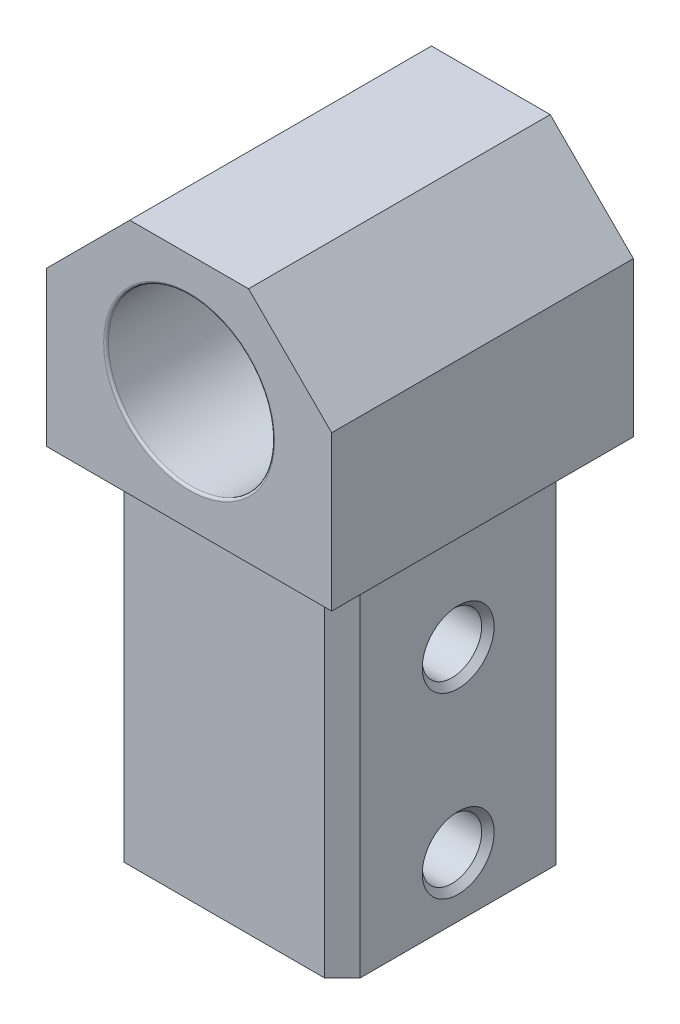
ISO-10303-21;
HEADER;
FILE_DESCRIPTION(('STEP AP214'),'2;1');
FILE_NAME('part.step','',(''),(''),'','','');
FILE_SCHEMA(('AUTOMOTIVE_DESIGN { 1 0 10303 214 1 1 1 1 }'));
ENDSEC;
DATA;
#1=APPLICATION_CONTEXT('core data for automotive mechanical design processes');
#2=APPLICATION_PROTOCOL_DEFINITION('international standard','automotive_design',2000,#1);
#3=PRODUCT_CONTEXT('',#1,'mechanical');
#4=PRODUCT('Part','Part','',(#3));
#5=PRODUCT_RELATED_PRODUCT_CATEGORY('part','',(#4));
#6=PRODUCT_DEFINITION_FORMATION('','',#4);
#7=PRODUCT_DEFINITION_CONTEXT('part definition',#1,'design');
#8=PRODUCT_DEFINITION('design','',#6,#7);
#9=PRODUCT_DEFINITION_SHAPE('','',#8);
#10=(LENGTH_UNIT() NAMED_UNIT(*) SI_UNIT(.MILLI.,.METRE.));
#11=(NAMED_UNIT(*) PLANE_ANGLE_UNIT() SI_UNIT($,.RADIAN.));
#12=(NAMED_UNIT(*) SI_UNIT($,.STERADIAN.) SOLID_ANGLE_UNIT());
#13=UNCERTAINTY_MEASURE_WITH_UNIT(LENGTH_MEASURE(1.E-05),#10,'distance_accuracy_value','');
#14=(GEOMETRIC_REPRESENTATION_CONTEXT(3) GLOBAL_UNCERTAINTY_ASSIGNED_CONTEXT((#13)) GLOBAL_UNIT_ASSIGNED_CONTEXT((#10,
#11,#12)) REPRESENTATION_CONTEXT('',''));
#15=CARTESIAN_POINT('',(0.,0.,0.));
#16=DIRECTION('',(0.,0.,1.));
#17=DIRECTION('',(1.,0.,0.));
#18=AXIS2_PLACEMENT_3D('',#15,#16,#17);
#19=CARTESIAN_POINT('',(9.95,-30.,-9.75));
#20=DIRECTION('',(1.,0.,0.));
#21=DIRECTION('',(0.,0.,-1.));
#22=AXIS2_PLACEMENT_3D('',#19,#20,#21);
#23=PLANE('',#22);
#24=CARTESIAN_POINT('',(9.95,-10.,0.));
#25=DIRECTION('',(1.,0.,0.));
#26=DIRECTION('',(0.,0.,-1.));
#27=AXIS2_PLACEMENT_3D('',#24,#25,#26);
#28=CIRCLE('',#27,3.025);
#29=CARTESIAN_POINT('',(9.95,-10.,-3.025));
#30=VERTEX_POINT('',#29);
#31=EDGE_CURVE('E347',#30,#30,#28,.T.);
#32=ORIENTED_EDGE('',*,*,#31,.F.);
#33=EDGE_LOOP('',(#32));
#34=FACE_BOUND('',#33,.T.);
#35=CARTESIAN_POINT('',(9.95,-25.,0.));
#36=DIRECTION('',(1.,0.,0.));
#37=DIRECTION('',(0.,0.,-1.));
#38=AXIS2_PLACEMENT_3D('',#35,#36,#37);
#39=CIRCLE('',#38,3.025);
#40=CARTESIAN_POINT('',(9.95,-25.,-3.025));
#41=VERTEX_POINT('',#40);
#42=EDGE_CURVE('E331',#41,#41,#39,.T.);
#43=ORIENTED_EDGE('',*,*,#42,.F.);
#44=EDGE_LOOP('',(#43));
#45=FACE_BOUND('',#44,.T.);
#46=DIRECTION('',(0.,0.,-1.));
#47=VECTOR('',#46,1.);
#48=CARTESIAN_POINT('',(9.95,-30.,-9.75));
#49=LINE('',#48,#47);
#50=CARTESIAN_POINT('',(9.95,-30.,8.24999999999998));
#51=VERTEX_POINT('',#50);
#52=CARTESIAN_POINT('',(9.95,-30.,-8.25000000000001));
#53=VERTEX_POINT('',#52);
#54=EDGE_CURVE('E194',#51,#53,#49,.T.);
#55=ORIENTED_EDGE('',*,*,#54,.T.);
#56=DIRECTION('',(0.,1.,0.));
#57=VECTOR('',#56,1.);
#58=CARTESIAN_POINT('',(9.95,-30.,-8.25000000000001));
#59=LINE('',#58,#57);
#60=CARTESIAN_POINT('',(9.95,0.,-8.25000000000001));
#61=VERTEX_POINT('',#60);
#62=EDGE_CURVE('E228',#53,#61,#59,.T.);
#63=ORIENTED_EDGE('',*,*,#62,.T.);
#64=DIRECTION('',(0.,0.,-1.));
#65=VECTOR('',#64,1.);
#66=CARTESIAN_POINT('',(9.95,0.,-9.75000000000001));
#67=LINE('',#66,#65);
#68=CARTESIAN_POINT('',(9.95,0.,8.24999999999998));
#69=VERTEX_POINT('',#68);
#70=EDGE_CURVE('E152',#69,#61,#67,.T.);
#71=ORIENTED_EDGE('',*,*,#70,.F.);
#72=DIRECTION('',(0.,-1.,0.));
#73=VECTOR('',#72,1.);
#74=CARTESIAN_POINT('',(9.95,-30.,8.24999999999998));
#75=LINE('',#74,#73);
#76=EDGE_CURVE('E211',#69,#51,#75,.T.);
#77=ORIENTED_EDGE('',*,*,#76,.T.);
#78=EDGE_LOOP('',(#55,#63,#71,#77));
#79=FACE_BOUND('',#78,.T.);
#80=ADVANCED_FACE('F40',(#34,#45,#79),#23,.T.);
#81=CARTESIAN_POINT('',(-9.95,-30.,9.75));
#82=DIRECTION('',(0.,0.,1.));
#83=DIRECTION('',(1.,0.,0.));
#84=AXIS2_PLACEMENT_3D('',#81,#82,#83);
#85=PLANE('',#84);
#86=DIRECTION('',(1.,0.,0.));
#87=VECTOR('',#86,1.);
#88=CARTESIAN_POINT('',(-9.95,-30.,9.75));
#89=LINE('',#88,#87);
#90=CARTESIAN_POINT('',(-8.44999999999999,-30.,9.75));
#91=VERTEX_POINT('',#90);
#92=CARTESIAN_POINT('',(8.44999999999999,-30.,9.75));
#93=VERTEX_POINT('',#92);
#94=EDGE_CURVE('E207',#91,#93,#89,.T.);
#95=ORIENTED_EDGE('',*,*,#94,.T.);
#96=DIRECTION('',(0.,1.,0.));
#97=VECTOR('',#96,1.);
#98=CARTESIAN_POINT('',(8.45,-30.,9.75));
#99=LINE('',#98,#97);
#100=CARTESIAN_POINT('',(8.44999999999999,0.,9.75));
#101=VERTEX_POINT('',#100);
#102=EDGE_CURVE('E254',#93,#101,#99,.T.);
#103=ORIENTED_EDGE('',*,*,#102,.T.);
#104=DIRECTION('',(1.,0.,0.));
#105=VECTOR('',#104,1.);
#106=CARTESIAN_POINT('',(-9.95,0.,9.75));
#107=LINE('',#106,#105);
#108=CARTESIAN_POINT('',(-8.44999999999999,0.,9.74999999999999));
#109=VERTEX_POINT('',#108);
#110=EDGE_CURVE('E199',#109,#101,#107,.T.);
#111=ORIENTED_EDGE('',*,*,#110,.F.);
#112=DIRECTION('',(0.,-1.,0.));
#113=VECTOR('',#112,1.);
#114=CARTESIAN_POINT('',(-8.44999999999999,-30.,9.75));
#115=LINE('',#114,#113);
#116=EDGE_CURVE('E251',#109,#91,#115,.T.);
#117=ORIENTED_EDGE('',*,*,#116,.T.);
#118=EDGE_LOOP('',(#95,#103,#111,#117));
#119=FACE_BOUND('',#118,.T.);
#120=ADVANCED_FACE('F382',(#119),#85,.T.);
#121=CARTESIAN_POINT('',(-9.95,-30.,-9.75));
#122=DIRECTION('',(-1.,0.,0.));
#123=DIRECTION('',(0.,0.,1.));
#124=AXIS2_PLACEMENT_3D('',#121,#122,#123);
#125=PLANE('',#124);
#126=CARTESIAN_POINT('',(-9.95,-10.,0.));
#127=DIRECTION('',(1.,0.,0.));
#128=DIRECTION('',(0.,0.,-1.));
#129=AXIS2_PLACEMENT_3D('',#126,#127,#128);
#130=CIRCLE('',#129,3.02499999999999);
#131=CARTESIAN_POINT('',(-9.95,-10.,-3.02499999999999));
#132=VERTEX_POINT('',#131);
#133=EDGE_CURVE('E351',#132,#132,#130,.T.);
#134=ORIENTED_EDGE('',*,*,#133,.T.);
#135=EDGE_LOOP('',(#134));
#136=FACE_BOUND('',#135,.T.);
#137=CARTESIAN_POINT('',(-9.95,-25.,0.));
#138=DIRECTION('',(1.,0.,0.));
#139=DIRECTION('',(0.,0.,-1.));
#140=AXIS2_PLACEMENT_3D('',#137,#138,#139);
#141=CIRCLE('',#140,3.025);
#142=CARTESIAN_POINT('',(-9.95,-25.,-3.025));
#143=VERTEX_POINT('',#142);
#144=EDGE_CURVE('E335',#143,#143,#141,.T.);
#145=ORIENTED_EDGE('',*,*,#144,.T.);
#146=EDGE_LOOP('',(#145));
#147=FACE_BOUND('',#146,.T.);
#148=DIRECTION('',(0.,0.,1.));
#149=VECTOR('',#148,1.);
#150=CARTESIAN_POINT('',(-9.95,-30.,-9.75));
#151=LINE('',#150,#149);
#152=CARTESIAN_POINT('',(-9.95,-30.,-8.25));
#153=VERTEX_POINT('',#152);
#154=CARTESIAN_POINT('',(-9.95,-30.,8.25000000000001));
#155=VERTEX_POINT('',#154);
#156=EDGE_CURVE('E203',#153,#155,#151,.T.);
#157=ORIENTED_EDGE('',*,*,#156,.T.);
#158=DIRECTION('',(0.,1.,0.));
#159=VECTOR('',#158,1.);
#160=CARTESIAN_POINT('',(-9.95,-30.,8.25000000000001));
#161=LINE('',#160,#159);
#162=CARTESIAN_POINT('',(-9.95,0.,8.25000000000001));
#163=VERTEX_POINT('',#162);
#164=EDGE_CURVE('E261',#155,#163,#161,.T.);
#165=ORIENTED_EDGE('',*,*,#164,.T.);
#166=DIRECTION('',(0.,0.,1.));
#167=VECTOR('',#166,1.);
#168=CARTESIAN_POINT('',(-9.95,0.,-9.75));
#169=LINE('',#168,#167);
#170=CARTESIAN_POINT('',(-9.95,0.,-8.25));
#171=VERTEX_POINT('',#170);
#172=EDGE_CURVE('E219',#171,#163,#169,.T.);
#173=ORIENTED_EDGE('',*,*,#172,.F.);
#174=DIRECTION('',(0.,-1.,0.));
#175=VECTOR('',#174,1.);
#176=CARTESIAN_POINT('',(-9.95,-30.,-8.25));
#177=LINE('',#176,#175);
#178=EDGE_CURVE('E258',#171,#153,#177,.T.);
#179=ORIENTED_EDGE('',*,*,#178,.T.);
#180=EDGE_LOOP('',(#157,#165,#173,#179));
#181=FACE_BOUND('',#180,.T.);
#182=ADVANCED_FACE('F357',(#136,#147,#181),#125,.T.);
#183=CARTESIAN_POINT('',(-9.95,-30.,-9.75));
#184=DIRECTION('',(0.,0.,-1.));
#185=DIRECTION('',(-1.,0.,0.));
#186=AXIS2_PLACEMENT_3D('',#183,#184,#185);
#187=PLANE('',#186);
#188=DIRECTION('',(-1.,0.,0.));
#189=VECTOR('',#188,1.);
#190=CARTESIAN_POINT('',(-9.95,0.,-9.75));
#191=LINE('',#190,#189);
#192=CARTESIAN_POINT('',(8.45,0.,-9.75));
#193=VERTEX_POINT('',#192);
#194=CARTESIAN_POINT('',(-8.45,0.,-9.75000000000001));
#195=VERTEX_POINT('',#194);
#196=EDGE_CURVE('E215',#193,#195,#191,.T.);
#197=ORIENTED_EDGE('',*,*,#196,.F.);
#198=DIRECTION('',(0.,-1.,0.));
#199=VECTOR('',#198,1.);
#200=CARTESIAN_POINT('',(8.45,-30.,-9.75));
#201=LINE('',#200,#199);
#202=CARTESIAN_POINT('',(8.45,-30.,-9.75));
#203=VERTEX_POINT('',#202);
#204=EDGE_CURVE('E236',#193,#203,#201,.T.);
#205=ORIENTED_EDGE('',*,*,#204,.T.);
#206=DIRECTION('',(-1.,0.,0.));
#207=VECTOR('',#206,1.);
#208=CARTESIAN_POINT('',(-9.95,-30.,-9.75));
#209=LINE('',#208,#207);
#210=CARTESIAN_POINT('',(-8.45,-30.,-9.75));
#211=VERTEX_POINT('',#210);
#212=EDGE_CURVE('E198',#203,#211,#209,.T.);
#213=ORIENTED_EDGE('',*,*,#212,.T.);
#214=DIRECTION('',(0.,1.,0.));
#215=VECTOR('',#214,1.);
#216=CARTESIAN_POINT('',(-8.45,-30.,-9.75));
#217=LINE('',#216,#215);
#218=EDGE_CURVE('E232',#211,#195,#217,.T.);
#219=ORIENTED_EDGE('',*,*,#218,.T.);
#220=EDGE_LOOP('',(#197,#205,#213,#219));
#221=FACE_BOUND('',#220,.T.);
#222=ADVANCED_FACE('F397',(#221),#187,.T.);
#223=CARTESIAN_POINT('',(0.,-30.,0.));
#224=DIRECTION('',(0.,1.,0.));
#225=DIRECTION('',(0.,0.,1.));
#226=AXIS2_PLACEMENT_3D('',#223,#224,#225);
#227=PLANE('',#226);
#228=ORIENTED_EDGE('',*,*,#212,.F.);
#229=DIRECTION('',(-0.707106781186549,0.,-0.707106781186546));
#230=VECTOR('',#229,1.);
#231=CARTESIAN_POINT('',(9.95,-30.,-8.25000000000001));
#232=LINE('',#231,#230);
#233=EDGE_CURVE('E248',#203,#53,#232,.F.);
#234=ORIENTED_EDGE('',*,*,#233,.T.);
#235=ORIENTED_EDGE('',*,*,#54,.F.);
#236=DIRECTION('',(0.707106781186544,0.,-0.707106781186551));
#237=VECTOR('',#236,1.);
#238=CARTESIAN_POINT('',(8.45,-30.,9.75));
#239=LINE('',#238,#237);
#240=EDGE_CURVE('E245',#51,#93,#239,.F.);
#241=ORIENTED_EDGE('',*,*,#240,.T.);
#242=ORIENTED_EDGE('',*,*,#94,.F.);
#243=DIRECTION('',(0.707106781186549,0.,0.707106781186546));
#244=VECTOR('',#243,1.);
#245=CARTESIAN_POINT('',(-9.95,-30.,8.25000000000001));
#246=LINE('',#245,#244);
#247=EDGE_CURVE('E242',#91,#155,#246,.F.);
#248=ORIENTED_EDGE('',*,*,#247,.T.);
#249=ORIENTED_EDGE('',*,*,#156,.F.);
#250=DIRECTION('',(-0.707106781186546,0.,0.707106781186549));
#251=VECTOR('',#250,1.);
#252=CARTESIAN_POINT('',(-8.45,-30.,-9.75));
#253=LINE('',#252,#251);
#254=EDGE_CURVE('E239',#153,#211,#253,.F.);
#255=ORIENTED_EDGE('',*,*,#254,.T.);
#256=EDGE_LOOP('',(#228,#234,#235,#241,#242,#248,#249,#255));
#257=FACE_BOUND('',#256,.T.);
#258=ADVANCED_FACE('F418',(#257),#227,.F.);
#259=CARTESIAN_POINT('',(0.,0.,0.));
#260=DIRECTION('',(0.,1.,0.));
#261=DIRECTION('',(0.,0.,1.));
#262=AXIS2_PLACEMENT_3D('',#259,#260,#261);
#263=PLANE('',#262);
#264=DIRECTION('',(1.,0.,0.));
#265=VECTOR('',#264,1.);
#266=CARTESIAN_POINT('',(-12.,0.,12.7));
#267=LINE('',#266,#265);
#268=CARTESIAN_POINT('',(-12.,0.,12.7));
#269=VERTEX_POINT('',#268);
#270=CARTESIAN_POINT('',(12.,0.,12.7));
#271=VERTEX_POINT('',#270);
#272=EDGE_CURVE('E160',#269,#271,#267,.T.);
#273=ORIENTED_EDGE('',*,*,#272,.F.);
#274=DIRECTION('',(0.,0.,1.));
#275=VECTOR('',#274,1.);
#276=CARTESIAN_POINT('',(-12.,0.,-12.7));
#277=LINE('',#276,#275);
#278=CARTESIAN_POINT('',(-12.,0.,-12.7));
#279=VERTEX_POINT('',#278);
#280=EDGE_CURVE('E184',#279,#269,#277,.T.);
#281=ORIENTED_EDGE('',*,*,#280,.F.);
#282=DIRECTION('',(-1.,0.,0.));
#283=VECTOR('',#282,1.);
#284=CARTESIAN_POINT('',(12.,0.,-12.7));
#285=LINE('',#284,#283);
#286=CARTESIAN_POINT('',(12.,0.,-12.7));
#287=VERTEX_POINT('',#286);
#288=EDGE_CURVE('E162',#287,#279,#285,.T.);
#289=ORIENTED_EDGE('',*,*,#288,.F.);
#290=DIRECTION('',(0.,0.,-1.));
#291=VECTOR('',#290,1.);
#292=CARTESIAN_POINT('',(12.,0.,12.7));
#293=LINE('',#292,#291);
#294=EDGE_CURVE('E145',#271,#287,#293,.T.);
#295=ORIENTED_EDGE('',*,*,#294,.F.);
#296=EDGE_LOOP('',(#273,#281,#289,#295));
#297=FACE_BOUND('',#296,.T.);
#298=ORIENTED_EDGE('',*,*,#172,.T.);
#299=DIRECTION('',(-0.707106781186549,0.,-0.707106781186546));
#300=VECTOR('',#299,1.);
#301=CARTESIAN_POINT('',(-9.09999999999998,0.,9.10000000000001));
#302=LINE('',#301,#300);
#303=EDGE_CURVE('E271',#163,#109,#302,.F.);
#304=ORIENTED_EDGE('',*,*,#303,.T.);
#305=ORIENTED_EDGE('',*,*,#110,.T.);
#306=DIRECTION('',(-0.707106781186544,0.,0.707106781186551));
#307=VECTOR('',#306,1.);
#308=CARTESIAN_POINT('',(9.10000000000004,0.,9.09999999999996));
#309=LINE('',#308,#307);
#310=EDGE_CURVE('E268',#101,#69,#309,.F.);
#311=ORIENTED_EDGE('',*,*,#310,.T.);
#312=ORIENTED_EDGE('',*,*,#70,.T.);
#313=DIRECTION('',(0.707106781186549,0.,0.707106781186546));
#314=VECTOR('',#313,1.);
#315=CARTESIAN_POINT('',(9.09999999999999,0.,-9.10000000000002));
#316=LINE('',#315,#314);
#317=EDGE_CURVE('E265',#61,#193,#316,.F.);
#318=ORIENTED_EDGE('',*,*,#317,.T.);
#319=ORIENTED_EDGE('',*,*,#196,.T.);
#320=DIRECTION('',(0.707106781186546,0.,-0.707106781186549));
#321=VECTOR('',#320,1.);
#322=CARTESIAN_POINT('',(-9.10000000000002,0.,-9.09999999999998));
#323=LINE('',#322,#321);
#324=EDGE_CURVE('E274',#195,#171,#323,.F.);
#325=ORIENTED_EDGE('',*,*,#324,.T.);
#326=EDGE_LOOP('',(#298,#304,#305,#311,#312,#318,#319,#325));
#327=FACE_BOUND('',#326,.T.);
#328=ADVANCED_FACE('F157',(#297,#327),#263,.F.);
#329=CARTESIAN_POINT('',(-12.,20.,12.7));
#330=DIRECTION('',(0.,0.,-1.));
#331=DIRECTION('',(-1.,0.,0.));
#332=AXIS2_PLACEMENT_3D('',#329,#330,#331);
#333=PLANE('',#332);
#334=CARTESIAN_POINT('',(0.,10.,12.7));
#335=DIRECTION('',(0.,0.,-1.));
#336=DIRECTION('',(-1.,0.,0.));
#337=AXIS2_PLACEMENT_3D('',#334,#335,#336);
#338=CIRCLE('',#337,7.2);
#339=CARTESIAN_POINT('',(-7.2,10.,12.7));
#340=VERTEX_POINT('',#339);
#341=EDGE_CURVE('E289',#340,#340,#338,.T.);
#342=ORIENTED_EDGE('',*,*,#341,.T.);
#343=EDGE_LOOP('',(#342));
#344=FACE_BOUND('',#343,.T.);
#345=DIRECTION('',(1.,0.,0.));
#346=VECTOR('',#345,1.);
#347=CARTESIAN_POINT('',(-12.,20.,12.7));
#348=LINE('',#347,#346);
#349=CARTESIAN_POINT('',(-5.,20.,12.7));
#350=VERTEX_POINT('',#349);
#351=CARTESIAN_POINT('',(5.,20.,12.7));
#352=VERTEX_POINT('',#351);
#353=EDGE_CURVE('E186',#350,#352,#348,.T.);
#354=ORIENTED_EDGE('',*,*,#353,.F.);
#355=DIRECTION('',(-0.707106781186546,-0.707106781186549,0.));
#356=VECTOR('',#355,1.);
#357=CARTESIAN_POINT('',(-5.,20.,12.7));
#358=LINE('',#357,#356);
#359=CARTESIAN_POINT('',(-12.,13.,12.7));
#360=VERTEX_POINT('',#359);
#361=EDGE_CURVE('E304',#350,#360,#358,.T.);
#362=ORIENTED_EDGE('',*,*,#361,.T.);
#363=DIRECTION('',(0.,-1.,0.));
#364=VECTOR('',#363,1.);
#365=CARTESIAN_POINT('',(-12.,20.,12.7));
#366=LINE('',#365,#364);
#367=EDGE_CURVE('E167',#360,#269,#366,.T.);
#368=ORIENTED_EDGE('',*,*,#367,.T.);
#369=ORIENTED_EDGE('',*,*,#272,.T.);
#370=DIRECTION('',(0.,-1.,0.));
#371=VECTOR('',#370,1.);
#372=CARTESIAN_POINT('',(12.,20.,12.7));
#373=LINE('',#372,#371);
#374=CARTESIAN_POINT('',(12.,13.,12.7));
#375=VERTEX_POINT('',#374);
#376=EDGE_CURVE('E142',#375,#271,#373,.T.);
#377=ORIENTED_EDGE('',*,*,#376,.F.);
#378=DIRECTION('',(-0.707106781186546,0.707106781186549,0.));
#379=VECTOR('',#378,1.);
#380=CARTESIAN_POINT('',(5.,20.,12.7));
#381=LINE('',#380,#379);
#382=EDGE_CURVE('E301',#375,#352,#381,.T.);
#383=ORIENTED_EDGE('',*,*,#382,.T.);
#384=EDGE_LOOP('',(#354,#362,#368,#369,#377,#383));
#385=FACE_BOUND('',#384,.T.);
#386=ADVANCED_FACE('F166',(#344,#385),#333,.F.);
#387=CARTESIAN_POINT('',(12.,20.,12.7));
#388=DIRECTION('',(-1.,0.,0.));
#389=DIRECTION('',(0.,0.,1.));
#390=AXIS2_PLACEMENT_3D('',#387,#388,#389);
#391=PLANE('',#390);
#392=DIRECTION('',(0.,-1.,0.));
#393=VECTOR('',#392,1.);
#394=CARTESIAN_POINT('',(12.,20.,-12.7));
#395=LINE('',#394,#393);
#396=CARTESIAN_POINT('',(12.,13.,-12.7));
#397=VERTEX_POINT('',#396);
#398=EDGE_CURVE('E153',#397,#287,#395,.T.);
#399=ORIENTED_EDGE('',*,*,#398,.F.);
#400=DIRECTION('',(0.,0.,1.));
#401=VECTOR('',#400,1.);
#402=CARTESIAN_POINT('',(12.,13.,12.7));
#403=LINE('',#402,#401);
#404=EDGE_CURVE('E11',#397,#375,#403,.T.);
#405=ORIENTED_EDGE('',*,*,#404,.T.);
#406=ORIENTED_EDGE('',*,*,#376,.T.);
#407=ORIENTED_EDGE('',*,*,#294,.T.);
#408=EDGE_LOOP('',(#399,#405,#406,#407));
#409=FACE_BOUND('',#408,.T.);
#410=ADVANCED_FACE('F144',(#409),#391,.F.);
#411=CARTESIAN_POINT('',(12.,20.,-12.7));
#412=DIRECTION('',(0.,0.,1.));
#413=DIRECTION('',(1.,0.,0.));
#414=AXIS2_PLACEMENT_3D('',#411,#412,#413);
#415=PLANE('',#414);
#416=CARTESIAN_POINT('',(0.,10.,-12.7));
#417=DIRECTION('',(0.,0.,1.));
#418=DIRECTION('',(1.,0.,0.));
#419=AXIS2_PLACEMENT_3D('',#416,#417,#418);
#420=CIRCLE('',#419,7.2);
#421=CARTESIAN_POINT('',(7.2,10.,-12.7));
#422=VERTEX_POINT('',#421);
#423=EDGE_CURVE('E277',#422,#422,#420,.T.);
#424=ORIENTED_EDGE('',*,*,#423,.T.);
#425=EDGE_LOOP('',(#424));
#426=FACE_BOUND('',#425,.T.);
#427=DIRECTION('',(0.,-1.,0.));
#428=VECTOR('',#427,1.);
#429=CARTESIAN_POINT('',(-12.,20.,-12.7));
#430=LINE('',#429,#428);
#431=CARTESIAN_POINT('',(-12.,12.9999999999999,-12.7));
#432=VERTEX_POINT('',#431);
#433=EDGE_CURVE('E189',#432,#279,#430,.T.);
#434=ORIENTED_EDGE('',*,*,#433,.F.);
#435=DIRECTION('',(0.707106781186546,0.707106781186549,0.));
#436=VECTOR('',#435,1.);
#437=CARTESIAN_POINT('',(-5.00000000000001,20.,-12.7));
#438=LINE('',#437,#436);
#439=CARTESIAN_POINT('',(-5.00000000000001,20.,-12.7));
#440=VERTEX_POINT('',#439);
#441=EDGE_CURVE('E49',#432,#440,#438,.T.);
#442=ORIENTED_EDGE('',*,*,#441,.T.);
#443=DIRECTION('',(-1.,0.,0.));
#444=VECTOR('',#443,1.);
#445=CARTESIAN_POINT('',(12.,20.,-12.7));
#446=LINE('',#445,#444);
#447=CARTESIAN_POINT('',(5.,20.,-12.7));
#448=VERTEX_POINT('',#447);
#449=EDGE_CURVE('E179',#448,#440,#446,.T.);
#450=ORIENTED_EDGE('',*,*,#449,.F.);
#451=DIRECTION('',(0.707106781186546,-0.707106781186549,0.));
#452=VECTOR('',#451,1.);
#453=CARTESIAN_POINT('',(5.,20.,-12.7));
#454=LINE('',#453,#452);
#455=EDGE_CURVE('E56',#448,#397,#454,.T.);
#456=ORIENTED_EDGE('',*,*,#455,.T.);
#457=ORIENTED_EDGE('',*,*,#398,.T.);
#458=ORIENTED_EDGE('',*,*,#288,.T.);
#459=EDGE_LOOP('',(#434,#442,#450,#456,#457,#458));
#460=FACE_BOUND('',#459,.T.);
#461=ADVANCED_FACE('F314',(#426,#460),#415,.F.);
#462=CARTESIAN_POINT('',(-12.,20.,-12.7));
#463=DIRECTION('',(1.,0.,0.));
#464=DIRECTION('',(0.,0.,-1.));
#465=AXIS2_PLACEMENT_3D('',#462,#463,#464);
#466=PLANE('',#465);
#467=ORIENTED_EDGE('',*,*,#367,.F.);
#468=DIRECTION('',(0.,0.,-1.));
#469=VECTOR('',#468,1.);
#470=CARTESIAN_POINT('',(-12.,12.9999999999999,-12.7));
#471=LINE('',#470,#469);
#472=EDGE_CURVE('E64',#360,#432,#471,.T.);
#473=ORIENTED_EDGE('',*,*,#472,.T.);
#474=ORIENTED_EDGE('',*,*,#433,.T.);
#475=ORIENTED_EDGE('',*,*,#280,.T.);
#476=EDGE_LOOP('',(#467,#473,#474,#475));
#477=FACE_BOUND('',#476,.T.);
#478=ADVANCED_FACE('F323',(#477),#466,.F.);
#479=CARTESIAN_POINT('',(0.,20.,0.));
#480=DIRECTION('',(0.,1.,0.));
#481=DIRECTION('',(0.,0.,1.));
#482=AXIS2_PLACEMENT_3D('',#479,#480,#481);
#483=PLANE('',#482);
#484=ORIENTED_EDGE('',*,*,#449,.T.);
#485=DIRECTION('',(0.,0.,1.));
#486=VECTOR('',#485,1.);
#487=CARTESIAN_POINT('',(-5.,20.,12.7));
#488=LINE('',#487,#486);
#489=EDGE_CURVE('E297',#440,#350,#488,.T.);
#490=ORIENTED_EDGE('',*,*,#489,.T.);
#491=ORIENTED_EDGE('',*,*,#353,.T.);
#492=DIRECTION('',(0.,0.,-1.));
#493=VECTOR('',#492,1.);
#494=CARTESIAN_POINT('',(5.,20.,-12.7));
#495=LINE('',#494,#493);
#496=EDGE_CURVE('E293',#352,#448,#495,.T.);
#497=ORIENTED_EDGE('',*,*,#496,.T.);
#498=EDGE_LOOP('',(#484,#490,#491,#497));
#499=FACE_BOUND('',#498,.T.);
#500=ADVANCED_FACE('F318',(#499),#483,.T.);
#501=CARTESIAN_POINT('',(-9.425,-25.,0.));
#502=DIRECTION('',(-1.,0.,0.));
#503=DIRECTION('',(0.,0.,1.));
#504=AXIS2_PLACEMENT_3D('',#501,#502,#503);
#505=CONICAL_SURFACE('',#504,2.5,0.785398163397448);
#506=ORIENTED_EDGE('',*,*,#144,.F.);
#507=EDGE_LOOP('',(#506));
#508=FACE_BOUND('',#507,.T.);
#509=CARTESIAN_POINT('',(-9.425,-25.,0.));
#510=DIRECTION('',(1.,0.,0.));
#511=DIRECTION('',(0.,0.,-1.));
#512=AXIS2_PLACEMENT_3D('',#509,#510,#511);
#513=CIRCLE('',#512,2.5);
#514=CARTESIAN_POINT('',(-9.425,-25.,-2.5));
#515=VERTEX_POINT('',#514);
#516=EDGE_CURVE('E170',#515,#515,#513,.T.);
#517=ORIENTED_EDGE('',*,*,#516,.T.);
#518=EDGE_LOOP('',(#517));
#519=FACE_BOUND('',#518,.T.);
#520=ADVANCED_FACE('F547',(#508,#519),#505,.F.);
#521=CARTESIAN_POINT('',(9.95,-25.,0.));
#522=DIRECTION('',(1.,0.,0.));
#523=DIRECTION('',(0.,0.,-1.));
#524=AXIS2_PLACEMENT_3D('',#521,#522,#523);
#525=CYLINDRICAL_SURFACE('',#524,2.5);
#526=ORIENTED_EDGE('',*,*,#516,.F.);
#527=EDGE_LOOP('',(#526));
#528=FACE_BOUND('',#527,.T.);
#529=CARTESIAN_POINT('',(9.425,-25.,0.));
#530=DIRECTION('',(1.,0.,0.));
#531=DIRECTION('',(0.,0.,-1.));
#532=AXIS2_PLACEMENT_3D('',#529,#530,#531);
#533=CIRCLE('',#532,2.5);
#534=CARTESIAN_POINT('',(9.425,-25.,-2.5));
#535=VERTEX_POINT('',#534);
#536=EDGE_CURVE('E176',#535,#535,#533,.T.);
#537=ORIENTED_EDGE('',*,*,#536,.T.);
#538=EDGE_LOOP('',(#537));
#539=FACE_BOUND('',#538,.T.);
#540=ADVANCED_FACE('F537',(#528,#539),#525,.F.);
#541=CARTESIAN_POINT('',(9.95,-25.,0.));
#542=DIRECTION('',(1.,0.,0.));
#543=DIRECTION('',(0.,0.,-1.));
#544=AXIS2_PLACEMENT_3D('',#541,#542,#543);
#545=CONICAL_SURFACE('',#544,3.025,0.785398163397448);
#546=ORIENTED_EDGE('',*,*,#536,.F.);
#547=EDGE_LOOP('',(#546));
#548=FACE_BOUND('',#547,.T.);
#549=ORIENTED_EDGE('',*,*,#42,.T.);
#550=EDGE_LOOP('',(#549));
#551=FACE_BOUND('',#550,.T.);
#552=ADVANCED_FACE('F364',(#548,#551),#545,.F.);
#553=CARTESIAN_POINT('',(-9.425,-10.,0.));
#554=DIRECTION('',(-1.,0.,0.));
#555=DIRECTION('',(0.,0.,1.));
#556=AXIS2_PLACEMENT_3D('',#553,#554,#555);
#557=CONICAL_SURFACE('',#556,2.5,0.785398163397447);
#558=ORIENTED_EDGE('',*,*,#133,.F.);
#559=EDGE_LOOP('',(#558));
#560=FACE_BOUND('',#559,.T.);
#561=CARTESIAN_POINT('',(-9.425,-10.,0.));
#562=DIRECTION('',(1.,0.,0.));
#563=DIRECTION('',(0.,0.,-1.));
#564=AXIS2_PLACEMENT_3D('',#561,#562,#563);
#565=CIRCLE('',#564,2.5);
#566=CARTESIAN_POINT('',(-9.425,-10.,-2.49999999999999));
#567=VERTEX_POINT('',#566);
#568=EDGE_CURVE('E339',#567,#567,#565,.T.);
#569=ORIENTED_EDGE('',*,*,#568,.T.);
#570=EDGE_LOOP('',(#569));
#571=FACE_BOUND('',#570,.T.);
#572=ADVANCED_FACE('F360',(#560,#571),#557,.F.);
#573=CARTESIAN_POINT('',(9.95,-10.,0.));
#574=DIRECTION('',(1.,0.,0.));
#575=DIRECTION('',(0.,0.,-1.));
#576=AXIS2_PLACEMENT_3D('',#573,#574,#575);
#577=CYLINDRICAL_SURFACE('',#576,2.5);
#578=ORIENTED_EDGE('',*,*,#568,.F.);
#579=EDGE_LOOP('',(#578));
#580=FACE_BOUND('',#579,.T.);
#581=CARTESIAN_POINT('',(9.425,-10.,0.));
#582=DIRECTION('',(1.,0.,0.));
#583=DIRECTION('',(0.,0.,-1.));
#584=AXIS2_PLACEMENT_3D('',#581,#582,#583);
#585=CIRCLE('',#584,2.5);
#586=CARTESIAN_POINT('',(9.425,-10.,-2.5));
#587=VERTEX_POINT('',#586);
#588=EDGE_CURVE('E343',#587,#587,#585,.T.);
#589=ORIENTED_EDGE('',*,*,#588,.T.);
#590=EDGE_LOOP('',(#589));
#591=FACE_BOUND('',#590,.T.);
#592=ADVANCED_FACE('F363',(#580,#591),#577,.F.);
#593=CARTESIAN_POINT('',(9.95,-10.,0.));
#594=DIRECTION('',(1.,0.,0.));
#595=DIRECTION('',(0.,0.,-1.));
#596=AXIS2_PLACEMENT_3D('',#593,#594,#595);
#597=CONICAL_SURFACE('',#596,3.025,0.785398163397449);
#598=ORIENTED_EDGE('',*,*,#588,.F.);
#599=EDGE_LOOP('',(#598));
#600=FACE_BOUND('',#599,.T.);
#601=ORIENTED_EDGE('',*,*,#31,.T.);
#602=EDGE_LOOP('',(#601));
#603=FACE_BOUND('',#602,.T.);
#604=ADVANCED_FACE('F370',(#600,#603),#597,.F.);
#605=CARTESIAN_POINT('',(9.95,-30.,-8.25000000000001));
#606=DIRECTION('',(-0.707106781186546,0.,0.707106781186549));
#607=DIRECTION('',(0.,1.,0.));
#608=AXIS2_PLACEMENT_3D('',#605,#606,#607);
#609=PLANE('',#608);
#610=ORIENTED_EDGE('',*,*,#233,.F.);
#611=ORIENTED_EDGE('',*,*,#204,.F.);
#612=ORIENTED_EDGE('',*,*,#317,.F.);
#613=ORIENTED_EDGE('',*,*,#62,.F.);
#614=EDGE_LOOP('',(#610,#611,#612,#613));
#615=FACE_BOUND('',#614,.T.);
#616=ADVANCED_FACE('F376',(#615),#609,.F.);
#617=CARTESIAN_POINT('',(8.45,-30.,9.75));
#618=DIRECTION('',(-0.707106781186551,0.,-0.707106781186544));
#619=DIRECTION('',(0.,1.,0.));
#620=AXIS2_PLACEMENT_3D('',#617,#618,#619);
#621=PLANE('',#620);
#622=ORIENTED_EDGE('',*,*,#240,.F.);
#623=ORIENTED_EDGE('',*,*,#76,.F.);
#624=ORIENTED_EDGE('',*,*,#310,.F.);
#625=ORIENTED_EDGE('',*,*,#102,.F.);
#626=EDGE_LOOP('',(#622,#623,#624,#625));
#627=FACE_BOUND('',#626,.T.);
#628=ADVANCED_FACE('F417',(#627),#621,.F.);
#629=CARTESIAN_POINT('',(-9.95,-30.,8.25000000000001));
#630=DIRECTION('',(0.707106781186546,0.,-0.707106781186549));
#631=DIRECTION('',(0.,1.,0.));
#632=AXIS2_PLACEMENT_3D('',#629,#630,#631);
#633=PLANE('',#632);
#634=ORIENTED_EDGE('',*,*,#247,.F.);
#635=ORIENTED_EDGE('',*,*,#116,.F.);
#636=ORIENTED_EDGE('',*,*,#303,.F.);
#637=ORIENTED_EDGE('',*,*,#164,.F.);
#638=EDGE_LOOP('',(#634,#635,#636,#637));
#639=FACE_BOUND('',#638,.T.);
#640=ADVANCED_FACE('F410',(#639),#633,.F.);
#641=CARTESIAN_POINT('',(-8.45,-30.,-9.75));
#642=DIRECTION('',(0.707106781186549,0.,0.707106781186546));
#643=DIRECTION('',(0.,1.,0.));
#644=AXIS2_PLACEMENT_3D('',#641,#642,#643);
#645=PLANE('',#644);
#646=ORIENTED_EDGE('',*,*,#254,.F.);
#647=ORIENTED_EDGE('',*,*,#178,.F.);
#648=ORIENTED_EDGE('',*,*,#324,.F.);
#649=ORIENTED_EDGE('',*,*,#218,.F.);
#650=EDGE_LOOP('',(#646,#647,#648,#649));
#651=FACE_BOUND('',#650,.T.);
#652=ADVANCED_FACE('F402',(#651),#645,.F.);
#653=CARTESIAN_POINT('',(0.,10.,-12.7));
#654=DIRECTION('',(0.,0.,1.));
#655=DIRECTION('',(1.,0.,0.));
#656=AXIS2_PLACEMENT_3D('',#653,#654,#655);
#657=CYLINDRICAL_SURFACE('',#656,7.);
#658=CARTESIAN_POINT('',(0.,10.,-12.5));
#659=DIRECTION('',(0.,0.,1.));
#660=DIRECTION('',(1.,0.,0.));
#661=AXIS2_PLACEMENT_3D('',#658,#659,#660);
#662=CIRCLE('',#661,7.);
#663=CARTESIAN_POINT('',(7.,10.,-12.5));
#664=VERTEX_POINT('',#663);
#665=EDGE_CURVE('E285',#664,#664,#662,.F.);
#666=ORIENTED_EDGE('',*,*,#665,.T.);
#667=EDGE_LOOP('',(#666));
#668=FACE_BOUND('',#667,.T.);
#669=CARTESIAN_POINT('',(0.,10.,12.5));
#670=DIRECTION('',(0.,0.,-1.));
#671=DIRECTION('',(-1.,0.,0.));
#672=AXIS2_PLACEMENT_3D('',#669,#670,#671);
#673=CIRCLE('',#672,7.);
#674=CARTESIAN_POINT('',(-7.,10.,12.5));
#675=VERTEX_POINT('',#674);
#676=EDGE_CURVE('E281',#675,#675,#673,.F.);
#677=ORIENTED_EDGE('',*,*,#676,.T.);
#678=EDGE_LOOP('',(#677));
#679=FACE_BOUND('',#678,.T.);
#680=ADVANCED_FACE('F442',(#668,#679),#657,.F.);
#681=CARTESIAN_POINT('',(0.,10.,-12.5));
#682=DIRECTION('',(0.,0.,1.));
#683=DIRECTION('',(1.,0.,0.));
#684=AXIS2_PLACEMENT_3D('',#681,#682,#683);
#685=TOROIDAL_SURFACE('',#684,7.2,0.2);
#686=ORIENTED_EDGE('',*,*,#665,.F.);
#687=EDGE_LOOP('',(#686));
#688=FACE_BOUND('',#687,.T.);
#689=ORIENTED_EDGE('',*,*,#423,.F.);
#690=EDGE_LOOP('',(#689));
#691=FACE_BOUND('',#690,.T.);
#692=ADVANCED_FACE('F443',(#688,#691),#685,.T.);
#693=CARTESIAN_POINT('',(0.,10.,12.5));
#694=DIRECTION('',(0.,0.,-1.));
#695=DIRECTION('',(-1.,0.,0.));
#696=AXIS2_PLACEMENT_3D('',#693,#694,#695);
#697=TOROIDAL_SURFACE('',#696,7.2,0.2);
#698=ORIENTED_EDGE('',*,*,#341,.F.);
#699=EDGE_LOOP('',(#698));
#700=FACE_BOUND('',#699,.T.);
#701=ORIENTED_EDGE('',*,*,#676,.F.);
#702=EDGE_LOOP('',(#701));
#703=FACE_BOUND('',#702,.T.);
#704=ADVANCED_FACE('F446',(#700,#703),#697,.T.);
#705=CARTESIAN_POINT('',(-5.00000000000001,20.,0.));
#706=DIRECTION('',(-0.707106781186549,0.707106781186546,0.));
#707=DIRECTION('',(0.,0.,-1.));
#708=AXIS2_PLACEMENT_3D('',#705,#706,#707);
#709=PLANE('',#708);
#710=ORIENTED_EDGE('',*,*,#441,.F.);
#711=ORIENTED_EDGE('',*,*,#472,.F.);
#712=ORIENTED_EDGE('',*,*,#361,.F.);
#713=ORIENTED_EDGE('',*,*,#489,.F.);
#714=EDGE_LOOP('',(#710,#711,#712,#713));
#715=FACE_BOUND('',#714,.T.);
#716=ADVANCED_FACE('F322',(#715),#709,.T.);
#717=CARTESIAN_POINT('',(5.,20.,0.));
#718=DIRECTION('',(0.707106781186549,0.707106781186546,0.));
#719=DIRECTION('',(0.,0.,1.));
#720=AXIS2_PLACEMENT_3D('',#717,#718,#719);
#721=PLANE('',#720);
#722=ORIENTED_EDGE('',*,*,#382,.F.);
#723=ORIENTED_EDGE('',*,*,#404,.F.);
#724=ORIENTED_EDGE('',*,*,#455,.F.);
#725=ORIENTED_EDGE('',*,*,#496,.F.);
#726=EDGE_LOOP('',(#722,#723,#724,#725));
#727=FACE_BOUND('',#726,.T.);
#728=ADVANCED_FACE('F42',(#727),#721,.T.);
#729=CLOSED_SHELL('',(#80,#120,#182,#222,#258,#328,#386,#410,#461,#478,#500,#520,#540,#552,#572,
#592,#604,#616,#628,#640,#652,#680,#692,#704,#716,#728));
#730=MANIFOLD_SOLID_BREP('B2',#729);
#731=ADVANCED_BREP_SHAPE_REPRESENTATION('',(#18,#730),#14);
#732=SHAPE_DEFINITION_REPRESENTATION(#9,#731);
ENDSEC;
END-ISO-10303-21;
